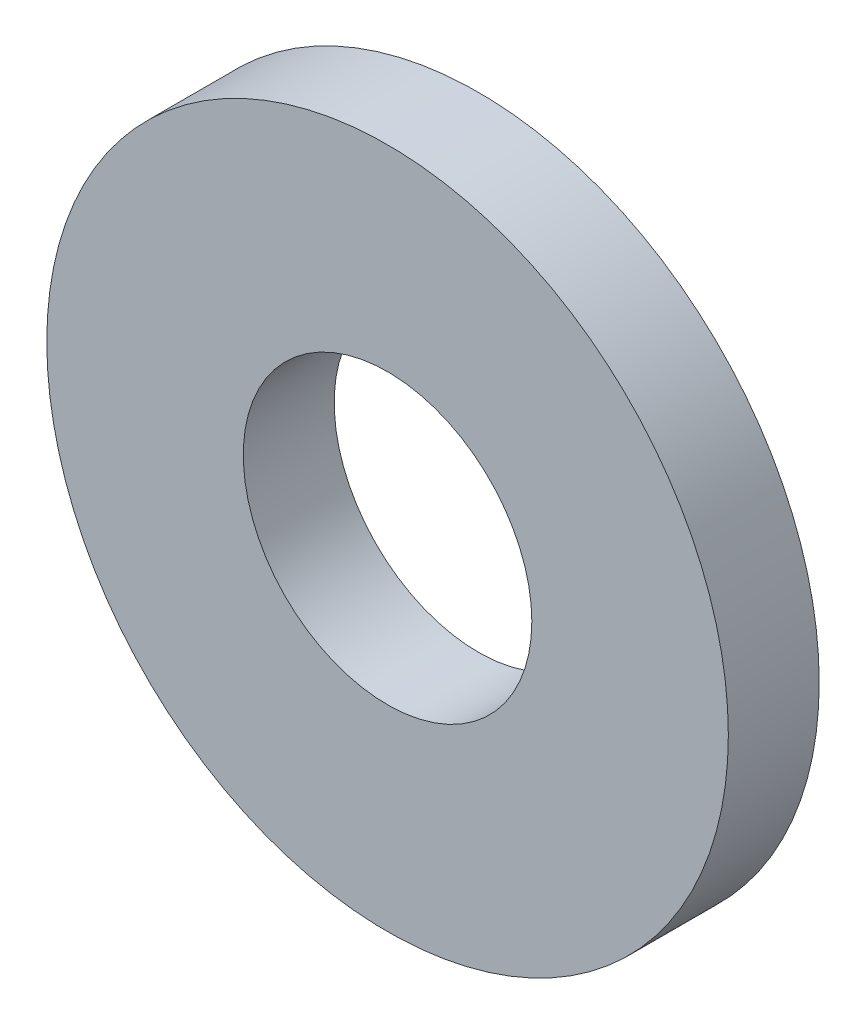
from build123d import *

# Parameters (mm, degrees)
SKETCH2_R      = 15
SKETCH2_R_2    = 6.35
EXTRUDE1_DEPTH = 4


with BuildPart() as part:
    # Sketch2 → Extrude1 (new body)
    with BuildSketch(Plane.XY):
        Circle(SKETCH2_R)
        Circle(SKETCH2_R_2, mode=Mode.SUBTRACT)
    extrude(amount=EXTRUDE1_DEPTH)


solid = part.part
